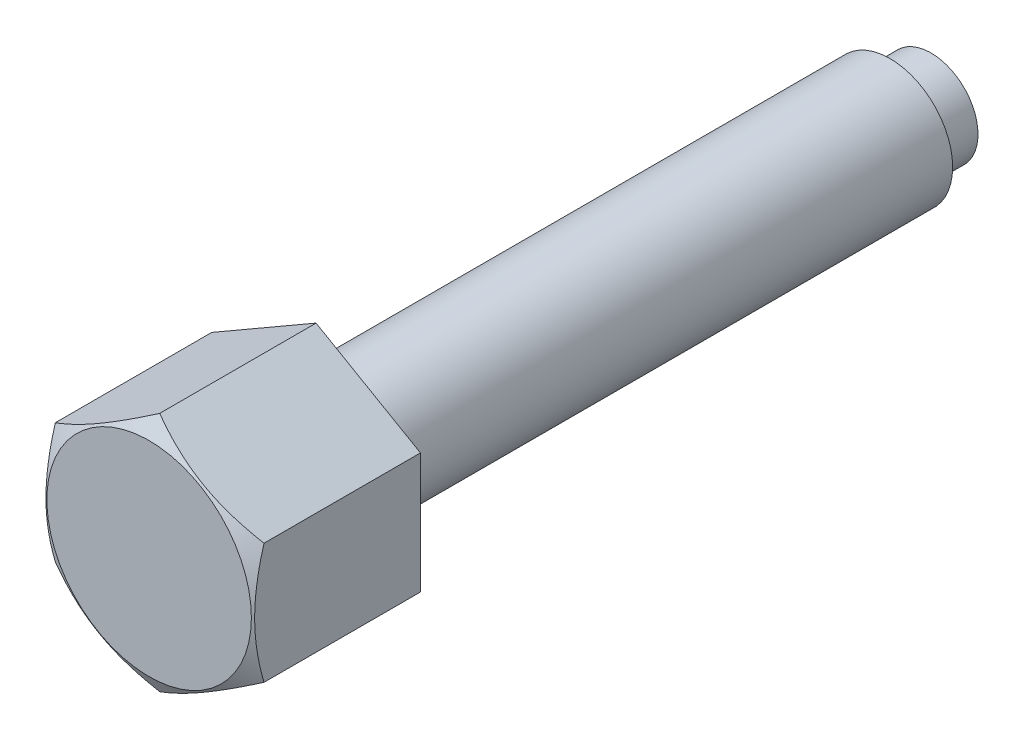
ISO-10303-21;
HEADER;
FILE_DESCRIPTION(('STEP AP214'),'2;1');
FILE_NAME('part.step','',(''),(''),'','','');
FILE_SCHEMA(('AUTOMOTIVE_DESIGN { 1 0 10303 214 1 1 1 1 }'));
ENDSEC;
DATA;
#1=APPLICATION_CONTEXT('core data for automotive mechanical design processes');
#2=APPLICATION_PROTOCOL_DEFINITION('international standard','automotive_design',2000,#1);
#3=PRODUCT_CONTEXT('',#1,'mechanical');
#4=PRODUCT('Part','Part','',(#3));
#5=PRODUCT_RELATED_PRODUCT_CATEGORY('part','',(#4));
#6=PRODUCT_DEFINITION_FORMATION('','',#4);
#7=PRODUCT_DEFINITION_CONTEXT('part definition',#1,'design');
#8=PRODUCT_DEFINITION('design','',#6,#7);
#9=PRODUCT_DEFINITION_SHAPE('','',#8);
#10=(LENGTH_UNIT() NAMED_UNIT(*) SI_UNIT(.MILLI.,.METRE.));
#11=(NAMED_UNIT(*) PLANE_ANGLE_UNIT() SI_UNIT($,.RADIAN.));
#12=(NAMED_UNIT(*) SI_UNIT($,.STERADIAN.) SOLID_ANGLE_UNIT());
#13=UNCERTAINTY_MEASURE_WITH_UNIT(LENGTH_MEASURE(1.E-05),#10,'distance_accuracy_value','');
#14=(GEOMETRIC_REPRESENTATION_CONTEXT(3) GLOBAL_UNCERTAINTY_ASSIGNED_CONTEXT((#13)) GLOBAL_UNIT_ASSIGNED_CONTEXT((#10,
#11,#12)) REPRESENTATION_CONTEXT('',''));
#15=CARTESIAN_POINT('',(0.,0.,0.));
#16=DIRECTION('',(0.,0.,1.));
#17=DIRECTION('',(1.,0.,0.));
#18=AXIS2_PLACEMENT_3D('',#15,#16,#17);
#19=CARTESIAN_POINT('',(0.,5.77350269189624,28.));
#20=DIRECTION('',(-0.5,-0.86602540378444,0.));
#21=DIRECTION('',(0.86602540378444,-0.5,0.));
#22=AXIS2_PLACEMENT_3D('',#19,#20,#21);
#23=PLANE('',#22);
#24=CARTESIAN_POINT('',(5.0002,2.88663587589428,37.4956163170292));
#25=CARTESIAN_POINT('',(4.78046540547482,3.01349970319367,37.5688784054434));
#26=CARTESIAN_POINT('',(4.55885141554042,3.14144859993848,37.6355136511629));
#27=CARTESIAN_POINT('',(4.11178600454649,3.3995619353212,37.7518259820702));
#28=CARTESIAN_POINT('',(3.88632664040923,3.52973095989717,37.8014619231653));
#29=CARTESIAN_POINT('',(3.43816769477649,3.78847564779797,37.8787139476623));
#30=CARTESIAN_POINT('',(3.21553790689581,3.91701101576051,37.9068445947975));
#31=CARTESIAN_POINT('',(2.88081009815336,4.11026620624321,37.9320700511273));
#32=CARTESIAN_POINT('',(2.76915780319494,4.1747286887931,37.9376515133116));
#33=CARTESIAN_POINT('',(2.5457500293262,4.30371322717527,37.9430627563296));
#34=CARTESIAN_POINT('',(2.43399455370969,4.36823528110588,37.9428927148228));
#35=CARTESIAN_POINT('',(2.12781576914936,4.54500768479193,37.934511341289));
#36=CARTESIAN_POINT('',(1.93349391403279,4.65719946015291,37.9204352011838));
#37=CARTESIAN_POINT('',(1.5461398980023,4.8808384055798,37.8757997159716));
#38=CARTESIAN_POINT('',(1.35310909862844,4.99228478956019,37.8452251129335));
#39=CARTESIAN_POINT('',(0.964974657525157,5.21637431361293,37.7687964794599));
#40=CARTESIAN_POINT('',(0.769920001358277,5.32898917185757,37.7226185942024));
#41=CARTESIAN_POINT('',(0.382719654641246,5.55253939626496,37.6178131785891));
#42=CARTESIAN_POINT('',(0.190569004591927,5.6634776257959,37.5592102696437));
#43=CARTESIAN_POINT('',(-0.000199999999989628,5.77361816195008,37.4956163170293));
#44=B_SPLINE_CURVE_WITH_KNOTS('',3,(#24,#25,#26,#27,#28,#29,#30,#31,#32,#33,#34,#35,#36,#37,#38,
#39,#40,#41,#42,#43),.UNSPECIFIED.,.F.,.F.,(4,2,2,2,2,2,2,2,2,4),(0.,0.79255584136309,
1.58701660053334,2.36181537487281,2.74884076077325,3.13585419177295,3.80962362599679,
4.48401723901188,5.17336882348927,5.86136694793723),.UNSPECIFIED.);
#45=CARTESIAN_POINT('',(5.,2.88675134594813,37.4956829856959));
#46=VERTEX_POINT('',#45);
#47=CARTESIAN_POINT('',(0.,5.77350269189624,37.4956829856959));
#48=VERTEX_POINT('',#47);
#49=EDGE_CURVE('E30',#46,#48,#44,.T.);
#50=ORIENTED_EDGE('',*,*,#49,.F.);
#51=DIRECTION('',(0.,0.,1.));
#52=VECTOR('',#51,1.);
#53=CARTESIAN_POINT('',(5.,2.88675134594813,28.));
#54=LINE('',#53,#52);
#55=CARTESIAN_POINT('',(5.,2.88675134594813,30.));
#56=VERTEX_POINT('',#55);
#57=EDGE_CURVE('E97',#56,#46,#54,.T.);
#58=ORIENTED_EDGE('',*,*,#57,.F.);
#59=DIRECTION('',(0.86602540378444,-0.5,0.));
#60=VECTOR('',#59,1.);
#61=CARTESIAN_POINT('',(4.75,3.03108891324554,30.));
#62=LINE('',#61,#60);
#63=CARTESIAN_POINT('',(0.,5.77350269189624,30.));
#64=VERTEX_POINT('',#63);
#65=EDGE_CURVE('E111',#64,#56,#62,.T.);
#66=ORIENTED_EDGE('',*,*,#65,.F.);
#67=DIRECTION('',(0.,0.,1.));
#68=VECTOR('',#67,1.);
#69=CARTESIAN_POINT('',(0.,5.77350269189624,28.));
#70=LINE('',#69,#68);
#71=EDGE_CURVE('E37',#64,#48,#70,.T.);
#72=ORIENTED_EDGE('',*,*,#71,.T.);
#73=EDGE_LOOP('',(#50,#58,#66,#72));
#74=FACE_BOUND('',#73,.T.);
#75=ADVANCED_FACE('F15',(#74),#23,.F.);
#76=CARTESIAN_POINT('',(5.,2.88675134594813,28.));
#77=DIRECTION('',(-1.,0.,0.));
#78=DIRECTION('',(0.,-1.,0.));
#79=AXIS2_PLACEMENT_3D('',#76,#77,#78);
#80=PLANE('',#79);
#81=CARTESIAN_POINT('',(5.,-7.73626587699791,35.5108145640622));
#82=CARTESIAN_POINT('',(5.,-7.51803395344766,35.6166045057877));
#83=CARTESIAN_POINT('',(5.,-7.29929913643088,35.7213749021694));
#84=CARTESIAN_POINT('',(5.,-6.86055621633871,35.9283028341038));
#85=CARTESIAN_POINT('',(5.,-6.64054791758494,36.0304599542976));
#86=CARTESIAN_POINT('',(5.,-6.19784836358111,36.2321053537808));
#87=CARTESIAN_POINT('',(5.,-5.97514901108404,36.3315759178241));
#88=CARTESIAN_POINT('',(5.,-5.52797276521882,36.5264224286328));
#89=CARTESIAN_POINT('',(5.,-5.3034959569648,36.6217985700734));
#90=CARTESIAN_POINT('',(5.,-4.84522838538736,36.8103282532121));
#91=CARTESIAN_POINT('',(5.,-4.61136846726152,36.9033146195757));
#92=CARTESIAN_POINT('',(5.,-4.14090595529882,37.0822063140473));
#93=CARTESIAN_POINT('',(5.,-3.90430305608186,37.1681108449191));
#94=CARTESIAN_POINT('',(5.,-3.4284269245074,37.3305705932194));
#95=CARTESIAN_POINT('',(5.,-3.18916027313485,37.4071448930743));
#96=CARTESIAN_POINT('',(5.,-2.70719488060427,37.5484751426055));
#97=CARTESIAN_POINT('',(5.,-2.46449725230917,37.6132348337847));
#98=CARTESIAN_POINT('',(5.,-1.97687778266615,37.7274721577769));
#99=CARTESIAN_POINT('',(5.,-1.73197558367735,37.7770320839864));
#100=CARTESIAN_POINT('',(5.,-1.23914432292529,37.8580568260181));
#101=CARTESIAN_POINT('',(5.,-0.991215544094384,37.8895233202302));
#102=CARTESIAN_POINT('',(5.,-0.496800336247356,37.9314387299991));
#103=CARTESIAN_POINT('',(5.,-0.250337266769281,37.9421564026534));
#104=CARTESIAN_POINT('',(5.,0.242617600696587,37.9423718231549));
#105=CARTESIAN_POINT('',(5.,0.48910939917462,37.9318691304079));
#106=CARTESIAN_POINT('',(5.,0.90811306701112,37.8967196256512));
#107=CARTESIAN_POINT('',(5.,1.08107513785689,37.8771373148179));
#108=CARTESIAN_POINT('',(5.,1.42571379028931,37.8287531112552));
#109=CARTESIAN_POINT('',(5.,1.5973901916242,37.7999499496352));
#110=CARTESIAN_POINT('',(5.,2.11027344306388,37.7012251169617));
#111=CARTESIAN_POINT('',(5.,2.44913862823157,37.6190066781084));
#112=CARTESIAN_POINT('',(5.,2.95580579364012,37.4766856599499));
#113=CARTESIAN_POINT('',(5.,3.126240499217,37.4254239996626));
#114=CARTESIAN_POINT('',(5.,3.46545379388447,37.3176385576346));
#115=CARTESIAN_POINT('',(5.,3.63423237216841,37.2611147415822));
#116=CARTESIAN_POINT('',(5.,3.97018806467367,37.143706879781));
#117=CARTESIAN_POINT('',(5.,4.1373657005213,37.0828243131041));
#118=CARTESIAN_POINT('',(5.,4.4703400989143,36.9574090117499));
#119=CARTESIAN_POINT('',(5.,4.63613687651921,36.8928763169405));
#120=CARTESIAN_POINT('',(5.,5.02279899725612,36.7382562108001));
#121=CARTESIAN_POINT('',(5.,5.24317767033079,36.6469541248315));
#122=CARTESIAN_POINT('',(5.,5.68209744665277,36.4600232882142));
#123=CARTESIAN_POINT('',(5.,5.90063844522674,36.3643942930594));
#124=CARTESIAN_POINT('',(5.,6.33621551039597,36.169666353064));
#125=CARTESIAN_POINT('',(5.,6.55325127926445,36.0705667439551));
#126=CARTESIAN_POINT('',(5.,6.98602870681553,35.8695768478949));
#127=CARTESIAN_POINT('',(5.,7.20177033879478,35.7676865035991));
#128=CARTESIAN_POINT('',(5.,7.84778351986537,35.4584362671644));
#129=CARTESIAN_POINT('',(5.,8.27643028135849,35.2476843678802));
#130=CARTESIAN_POINT('',(5.,9.13064524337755,34.8200322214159));
#131=CARTESIAN_POINT('',(5.,9.55621333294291,34.603131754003));
#132=CARTESIAN_POINT('',(5.,10.1754231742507,34.2834910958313));
#133=CARTESIAN_POINT('',(5.,10.3699617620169,34.1824831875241));
#134=CARTESIAN_POINT('',(5.,10.7586153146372,33.9796640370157));
#135=CARTESIAN_POINT('',(5.,10.9527302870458,33.8778528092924));
#136=CARTESIAN_POINT('',(5.,11.534541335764,33.571367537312));
#137=CARTESIAN_POINT('',(5.,11.921687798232,33.3656500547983));
#138=CARTESIAN_POINT('',(5.,12.6939118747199,32.952589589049));
#139=CARTESIAN_POINT('',(5.,13.078992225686,32.7452517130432));
#140=CARTESIAN_POINT('',(5.,13.8482220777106,32.3289045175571));
#141=CARTESIAN_POINT('',(5.,14.2323716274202,32.1198952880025));
#142=CARTESIAN_POINT('',(5.,14.616177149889,31.9102601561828));
#143=B_SPLINE_CURVE_WITH_KNOTS('',3,(#81,#82,#83,#84,#85,#86,#87,#88,#89,#90,#91,#92,#93,#94,
#95,#96,#97,#98,#99,#100,#101,#102,#103,#104,#105,#106,#107,#108,#109,#110,#111,#112,#113,#114,
#115,#116,#117,#118,#119,#120,#121,#122,#123,#124,#125,#126,#127,#128,#129,#130,#131,#132,#133,
#134,#135,#136,#137,#138,#139,#140,#141,#142),.UNSPECIFIED.,.F.,.F.,(4,2,2,2,2,2,2,2,2,2,2,2,2,
2,2,2,2,2,2,2,2,2,2,2,2,2,2,2,2,2,4),(0.,0.727573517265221,1.45526196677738,2.18694240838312,
2.91858802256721,3.6735042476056,4.4285053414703,5.18193540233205,5.93512644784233,
6.68416454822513,7.4331331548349,8.17233378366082,8.91154976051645,9.43349738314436,
9.95551686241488,11.0001429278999,11.5340289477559,12.067918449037,12.6016276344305,
13.1353309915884,13.8508986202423,14.566506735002,15.2822525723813,15.9980131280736,
17.4308944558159,18.8638271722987,19.521420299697,20.1790016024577,21.4942173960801,
22.8062660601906,24.1182445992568),.UNSPECIFIED.);
#144=CARTESIAN_POINT('',(5.,-2.88675134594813,37.4956829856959));
#145=VERTEX_POINT('',#144);
#146=EDGE_CURVE('E157',#145,#46,#143,.T.);
#147=ORIENTED_EDGE('',*,*,#146,.F.);
#148=DIRECTION('',(0.,0.,1.));
#149=VECTOR('',#148,1.);
#150=CARTESIAN_POINT('',(5.,-2.88675134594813,28.));
#151=LINE('',#150,#149);
#152=CARTESIAN_POINT('',(5.,-2.88675134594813,30.));
#153=VERTEX_POINT('',#152);
#154=EDGE_CURVE('E94',#153,#145,#151,.T.);
#155=ORIENTED_EDGE('',*,*,#154,.F.);
#156=DIRECTION('',(0.,-1.,0.));
#157=VECTOR('',#156,1.);
#158=CARTESIAN_POINT('',(5.,0.,30.));
#159=LINE('',#158,#157);
#160=EDGE_CURVE('E108',#56,#153,#159,.T.);
#161=ORIENTED_EDGE('',*,*,#160,.F.);
#162=ORIENTED_EDGE('',*,*,#57,.T.);
#163=EDGE_LOOP('',(#147,#155,#161,#162));
#164=FACE_BOUND('',#163,.T.);
#165=ADVANCED_FACE('F137',(#164),#80,.F.);
#166=CARTESIAN_POINT('',(0.,-5.77350269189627,28.));
#167=DIRECTION('',(0.5,-0.866025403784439,0.));
#168=DIRECTION('',(0.866025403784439,0.5,0.));
#169=AXIS2_PLACEMENT_3D('',#166,#167,#168);
#170=PLANE('',#169);
#171=ORIENTED_EDGE('',*,*,#154,.T.);
#172=CARTESIAN_POINT('',(5.0002,-2.88663587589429,37.4956163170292));
#173=CARTESIAN_POINT('',(4.78046540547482,-3.01349970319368,37.5688784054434));
#174=CARTESIAN_POINT('',(4.55885141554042,-3.14144859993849,37.6355136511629));
#175=CARTESIAN_POINT('',(4.11178600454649,-3.39956193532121,37.7518259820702));
#176=CARTESIAN_POINT('',(3.88632664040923,-3.52973095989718,37.8014619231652));
#177=CARTESIAN_POINT('',(3.43816769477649,-3.78847564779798,37.8787139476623));
#178=CARTESIAN_POINT('',(3.21553790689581,-3.91701101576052,37.9068445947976));
#179=CARTESIAN_POINT('',(2.88081009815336,-4.11026620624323,37.9320700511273));
#180=CARTESIAN_POINT('',(2.76915780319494,-4.17472868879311,37.9376515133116));
#181=CARTESIAN_POINT('',(2.5457500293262,-4.30371322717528,37.9430627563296));
#182=CARTESIAN_POINT('',(2.43399455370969,-4.36823528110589,37.9428927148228));
#183=CARTESIAN_POINT('',(2.12781576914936,-4.54500768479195,37.934511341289));
#184=CARTESIAN_POINT('',(1.93349391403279,-4.65719946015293,37.9204352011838));
#185=CARTESIAN_POINT('',(1.54613989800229,-4.88083840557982,37.8757997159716));
#186=CARTESIAN_POINT('',(1.35310909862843,-4.99228478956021,37.8452251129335));
#187=CARTESIAN_POINT('',(0.964974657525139,-5.21637431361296,37.7687964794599));
#188=CARTESIAN_POINT('',(0.769920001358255,-5.3289891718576,37.7226185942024));
#189=CARTESIAN_POINT('',(0.38271965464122,-5.55253939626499,37.6178131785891));
#190=CARTESIAN_POINT('',(0.190569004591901,-5.66347762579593,37.5592102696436));
#191=CARTESIAN_POINT('',(-0.00020000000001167,-5.77361816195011,37.4956163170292));
#192=B_SPLINE_CURVE_WITH_KNOTS('',3,(#172,#173,#174,#175,#176,#177,#178,#179,#180,#181,#182,
#183,#184,#185,#186,#187,#188,#189,#190,#191),.UNSPECIFIED.,.F.,.F.,(4,2,2,2,2,2,2,2,2,4),(0.,
0.792555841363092,1.58701660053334,2.36181537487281,2.74884076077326,3.13585419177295,
3.8096236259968,4.4840172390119,5.1733688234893,5.86136694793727),.UNSPECIFIED.);
#193=CARTESIAN_POINT('',(0.,-5.77350269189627,37.4956829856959));
#194=VERTEX_POINT('',#193);
#195=EDGE_CURVE('E163',#145,#194,#192,.T.);
#196=ORIENTED_EDGE('',*,*,#195,.T.);
#197=DIRECTION('',(0.,0.,1.));
#198=VECTOR('',#197,1.);
#199=CARTESIAN_POINT('',(0.,-5.77350269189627,28.));
#200=LINE('',#199,#198);
#201=CARTESIAN_POINT('',(0.,-5.77350269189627,30.));
#202=VERTEX_POINT('',#201);
#203=EDGE_CURVE('E87',#202,#194,#200,.T.);
#204=ORIENTED_EDGE('',*,*,#203,.F.);
#205=DIRECTION('',(0.866025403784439,0.5,0.));
#206=VECTOR('',#205,1.);
#207=CARTESIAN_POINT('',(4.75,-3.03108891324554,30.));
#208=LINE('',#207,#206);
#209=EDGE_CURVE('E106',#202,#153,#208,.T.);
#210=ORIENTED_EDGE('',*,*,#209,.T.);
#211=EDGE_LOOP('',(#171,#196,#204,#210));
#212=FACE_BOUND('',#211,.T.);
#213=ADVANCED_FACE('F143',(#212),#170,.T.);
#214=CARTESIAN_POINT('',(0.,-5.77350269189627,28.));
#215=DIRECTION('',(0.5,0.866025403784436,0.));
#216=DIRECTION('',(-0.866025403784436,0.5,0.));
#217=AXIS2_PLACEMENT_3D('',#214,#215,#216);
#218=PLANE('',#217);
#219=CARTESIAN_POINT('',(-5.0002,-2.8866358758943,37.4956163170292));
#220=CARTESIAN_POINT('',(-4.78046540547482,-3.01349970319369,37.5688784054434));
#221=CARTESIAN_POINT('',(-4.55885141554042,-3.1414485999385,37.6355136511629));
#222=CARTESIAN_POINT('',(-4.11178600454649,-3.39956193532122,37.7518259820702));
#223=CARTESIAN_POINT('',(-3.88632664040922,-3.52973095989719,37.8014619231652));
#224=CARTESIAN_POINT('',(-3.43816769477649,-3.78847564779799,37.8787139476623));
#225=CARTESIAN_POINT('',(-3.21553790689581,-3.91701101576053,37.9068445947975));
#226=CARTESIAN_POINT('',(-2.88081009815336,-4.11026620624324,37.9320700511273));
#227=CARTESIAN_POINT('',(-2.76915780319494,-4.17472868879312,37.9376515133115));
#228=CARTESIAN_POINT('',(-2.5457500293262,-4.30371322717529,37.9430627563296));
#229=CARTESIAN_POINT('',(-2.43399455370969,-4.3682352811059,37.9428927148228));
#230=CARTESIAN_POINT('',(-2.12781576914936,-4.54500768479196,37.934511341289));
#231=CARTESIAN_POINT('',(-1.93349391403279,-4.65719946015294,37.9204352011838));
#232=CARTESIAN_POINT('',(-1.5461398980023,-4.88083840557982,37.8757997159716));
#233=CARTESIAN_POINT('',(-1.35310909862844,-4.99228478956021,37.8452251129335));
#234=CARTESIAN_POINT('',(-0.964974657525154,-5.21637431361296,37.7687964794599));
#235=CARTESIAN_POINT('',(-0.769920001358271,-5.3289891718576,37.7226185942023));
#236=CARTESIAN_POINT('',(-0.38271965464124,-5.552539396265,37.6178131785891));
#237=CARTESIAN_POINT('',(-0.190569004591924,-5.66347762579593,37.5592102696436));
#238=CARTESIAN_POINT('',(0.000199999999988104,-5.77361816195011,37.4956163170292));
#239=B_SPLINE_CURVE_WITH_KNOTS('',3,(#219,#220,#221,#222,#223,#224,#225,#226,#227,#228,#229,
#230,#231,#232,#233,#234,#235,#236,#237,#238),.UNSPECIFIED.,.F.,.F.,(4,2,2,2,2,2,2,2,2,4),(0.,
0.792555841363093,1.58701660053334,2.36181537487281,2.74884076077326,3.13585419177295,
3.80962362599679,4.48401723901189,5.17336882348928,5.86136694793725),.UNSPECIFIED.);
#240=CARTESIAN_POINT('',(-5.,-2.88675134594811,37.4956829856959));
#241=VERTEX_POINT('',#240);
#242=EDGE_CURVE('E81',#241,#194,#239,.T.);
#243=ORIENTED_EDGE('',*,*,#242,.F.);
#244=DIRECTION('',(0.,0.,1.));
#245=VECTOR('',#244,1.);
#246=CARTESIAN_POINT('',(-5.,-2.88675134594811,28.));
#247=LINE('',#246,#245);
#248=CARTESIAN_POINT('',(-5.,-2.88675134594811,30.));
#249=VERTEX_POINT('',#248);
#250=EDGE_CURVE('E80',#249,#241,#247,.T.);
#251=ORIENTED_EDGE('',*,*,#250,.F.);
#252=DIRECTION('',(-0.866025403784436,0.5,0.));
#253=VECTOR('',#252,1.);
#254=CARTESIAN_POINT('',(-0.250000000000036,-5.62916512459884,30.));
#255=LINE('',#254,#253);
#256=EDGE_CURVE('E103',#202,#249,#255,.T.);
#257=ORIENTED_EDGE('',*,*,#256,.F.);
#258=ORIENTED_EDGE('',*,*,#203,.T.);
#259=EDGE_LOOP('',(#243,#251,#257,#258));
#260=FACE_BOUND('',#259,.T.);
#261=ADVANCED_FACE('F239',(#260),#218,.F.);
#262=CARTESIAN_POINT('',(-5.,2.88675134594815,28.));
#263=DIRECTION('',(-1.,0.,0.));
#264=DIRECTION('',(0.,-1.,0.));
#265=AXIS2_PLACEMENT_3D('',#262,#263,#264);
#266=PLANE('',#265);
#267=ORIENTED_EDGE('',*,*,#250,.T.);
#268=CARTESIAN_POINT('',(-5.,-7.73626587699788,35.5108145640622));
#269=CARTESIAN_POINT('',(-5.,-7.51803395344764,35.6166045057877));
#270=CARTESIAN_POINT('',(-5.,-7.29929913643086,35.7213749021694));
#271=CARTESIAN_POINT('',(-5.,-6.86055621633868,35.9283028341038));
#272=CARTESIAN_POINT('',(-5.,-6.64054791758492,36.0304599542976));
#273=CARTESIAN_POINT('',(-5.,-6.19784836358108,36.2321053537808));
#274=CARTESIAN_POINT('',(-5.,-5.97514901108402,36.3315759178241));
#275=CARTESIAN_POINT('',(-5.,-5.5279727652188,36.5264224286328));
#276=CARTESIAN_POINT('',(-5.,-5.30349595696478,36.6217985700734));
#277=CARTESIAN_POINT('',(-5.,-4.84522838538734,36.8103282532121));
#278=CARTESIAN_POINT('',(-5.,-4.6113684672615,36.9033146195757));
#279=CARTESIAN_POINT('',(-5.,-4.1409059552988,37.0822063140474));
#280=CARTESIAN_POINT('',(-5.,-3.90430305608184,37.1681108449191));
#281=CARTESIAN_POINT('',(-5.,-3.42842692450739,37.3305705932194));
#282=CARTESIAN_POINT('',(-5.,-3.18916027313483,37.4071448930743));
#283=CARTESIAN_POINT('',(-5.,-2.70719488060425,37.5484751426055));
#284=CARTESIAN_POINT('',(-5.,-2.46449725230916,37.6132348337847));
#285=CARTESIAN_POINT('',(-5.,-1.97687778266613,37.7274721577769));
#286=CARTESIAN_POINT('',(-5.,-1.73197558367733,37.7770320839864));
#287=CARTESIAN_POINT('',(-5.,-1.23914432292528,37.8580568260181));
#288=CARTESIAN_POINT('',(-5.,-0.99121554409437,37.8895233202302));
#289=CARTESIAN_POINT('',(-5.,-0.496800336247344,37.9314387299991));
#290=CARTESIAN_POINT('',(-5.,-0.250337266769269,37.9421564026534));
#291=CARTESIAN_POINT('',(-5.,0.242617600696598,37.9423718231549));
#292=CARTESIAN_POINT('',(-5.,0.489109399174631,37.9318691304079));
#293=CARTESIAN_POINT('',(-5.,0.908113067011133,37.8967196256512));
#294=CARTESIAN_POINT('',(-5.,1.08107513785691,37.8771373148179));
#295=CARTESIAN_POINT('',(-5.,1.42571379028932,37.8287531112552));
#296=CARTESIAN_POINT('',(-5.,1.59739019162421,37.7999499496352));
#297=CARTESIAN_POINT('',(-5.,2.1102734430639,37.7012251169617));
#298=CARTESIAN_POINT('',(-5.,2.44913862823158,37.6190066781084));
#299=CARTESIAN_POINT('',(-5.,2.95580579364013,37.4766856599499));
#300=CARTESIAN_POINT('',(-5.,3.12624049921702,37.4254239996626));
#301=CARTESIAN_POINT('',(-5.,3.46545379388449,37.3176385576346));
#302=CARTESIAN_POINT('',(-5.,3.63423237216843,37.2611147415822));
#303=CARTESIAN_POINT('',(-5.,3.97018806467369,37.143706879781));
#304=CARTESIAN_POINT('',(-5.,4.13736570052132,37.0828243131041));
#305=CARTESIAN_POINT('',(-5.,4.47034009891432,36.9574090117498));
#306=CARTESIAN_POINT('',(-5.,4.63613687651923,36.8928763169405));
#307=CARTESIAN_POINT('',(-5.,5.02279899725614,36.7382562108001));
#308=CARTESIAN_POINT('',(-5.,5.24317767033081,36.6469541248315));
#309=CARTESIAN_POINT('',(-5.,5.68209744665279,36.4600232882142));
#310=CARTESIAN_POINT('',(-5.,5.90063844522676,36.3643942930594));
#311=CARTESIAN_POINT('',(-5.,6.33621551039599,36.169666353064));
#312=CARTESIAN_POINT('',(-5.,6.55325127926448,36.0705667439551));
#313=CARTESIAN_POINT('',(-5.,6.98602870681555,35.8695768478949));
#314=CARTESIAN_POINT('',(-5.,7.2017703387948,35.7676865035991));
#315=CARTESIAN_POINT('',(-5.,7.84778351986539,35.4584362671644));
#316=CARTESIAN_POINT('',(-5.,8.2764302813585,35.2476843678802));
#317=CARTESIAN_POINT('',(-5.,9.13064524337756,34.8200322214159));
#318=CARTESIAN_POINT('',(-5.,9.55621333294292,34.603131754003));
#319=CARTESIAN_POINT('',(-5.,10.1754231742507,34.2834910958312));
#320=CARTESIAN_POINT('',(-5.,10.369961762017,34.1824831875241));
#321=CARTESIAN_POINT('',(-5.,10.7586153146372,33.9796640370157));
#322=CARTESIAN_POINT('',(-5.,10.9527302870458,33.8778528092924));
#323=CARTESIAN_POINT('',(-5.,11.534541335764,33.571367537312));
#324=CARTESIAN_POINT('',(-5.,11.921687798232,33.3656500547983));
#325=CARTESIAN_POINT('',(-5.,12.6939118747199,32.952589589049));
#326=CARTESIAN_POINT('',(-5.,13.078992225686,32.7452517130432));
#327=CARTESIAN_POINT('',(-5.,13.8482220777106,32.3289045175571));
#328=CARTESIAN_POINT('',(-5.,14.2323716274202,32.1198952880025));
#329=CARTESIAN_POINT('',(-5.,14.616177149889,31.9102601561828));
#330=B_SPLINE_CURVE_WITH_KNOTS('',3,(#268,#269,#270,#271,#272,#273,#274,#275,#276,#277,#278,
#279,#280,#281,#282,#283,#284,#285,#286,#287,#288,#289,#290,#291,#292,#293,#294,#295,#296,#297,
#298,#299,#300,#301,#302,#303,#304,#305,#306,#307,#308,#309,#310,#311,#312,#313,#314,#315,#316,
#317,#318,#319,#320,#321,#322,#323,#324,#325,#326,#327,#328,#329),.UNSPECIFIED.,.F.,.F.,(4,2,2,
2,2,2,2,2,2,2,2,2,2,2,2,2,2,2,2,2,2,2,2,2,2,2,2,2,2,2,4),(0.,0.727573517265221,1.45526196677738,
2.18694240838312,2.9185880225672,3.67350424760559,4.42850534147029,5.18193540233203,
5.93512644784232,6.68416454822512,7.43313315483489,8.1723337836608,8.91154976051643,
9.43349738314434,9.95551686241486,11.0001429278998,11.5340289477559,12.067918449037,
12.6016276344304,13.1353309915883,13.8508986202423,14.566506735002,15.2822525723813,
15.9980131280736,17.4308944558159,18.8638271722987,19.521420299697,20.1790016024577,
21.49421739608,22.8062660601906,24.1182445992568),.UNSPECIFIED.);
#331=CARTESIAN_POINT('',(-5.,2.88675134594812,37.4956829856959));
#332=VERTEX_POINT('',#331);
#333=EDGE_CURVE('E68',#241,#332,#330,.T.);
#334=ORIENTED_EDGE('',*,*,#333,.T.);
#335=DIRECTION('',(0.,0.,1.));
#336=VECTOR('',#335,1.);
#337=CARTESIAN_POINT('',(-5.,2.88675134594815,28.));
#338=LINE('',#337,#336);
#339=CARTESIAN_POINT('',(-5.,2.88675134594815,30.));
#340=VERTEX_POINT('',#339);
#341=EDGE_CURVE('E77',#340,#332,#338,.T.);
#342=ORIENTED_EDGE('',*,*,#341,.F.);
#343=DIRECTION('',(0.,-1.,0.));
#344=VECTOR('',#343,1.);
#345=CARTESIAN_POINT('',(-5.,0.,30.));
#346=LINE('',#345,#344);
#347=EDGE_CURVE('E101',#340,#249,#346,.T.);
#348=ORIENTED_EDGE('',*,*,#347,.T.);
#349=EDGE_LOOP('',(#267,#334,#342,#348));
#350=FACE_BOUND('',#349,.T.);
#351=ADVANCED_FACE('F76',(#350),#266,.T.);
#352=CARTESIAN_POINT('',(0.,5.77350269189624,28.));
#353=DIRECTION('',(-0.5,0.866025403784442,0.));
#354=DIRECTION('',(-0.866025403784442,-0.5,0.));
#355=AXIS2_PLACEMENT_3D('',#352,#353,#354);
#356=PLANE('',#355);
#357=ORIENTED_EDGE('',*,*,#341,.T.);
#358=CARTESIAN_POINT('',(-5.0002,2.88663587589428,37.4956163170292));
#359=CARTESIAN_POINT('',(-4.78046540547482,3.01349970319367,37.5688784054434));
#360=CARTESIAN_POINT('',(-4.55885141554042,3.14144859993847,37.6355136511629));
#361=CARTESIAN_POINT('',(-4.11178600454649,3.39956193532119,37.7518259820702));
#362=CARTESIAN_POINT('',(-3.88632664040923,3.52973095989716,37.8014619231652));
#363=CARTESIAN_POINT('',(-3.4381676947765,3.78847564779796,37.8787139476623));
#364=CARTESIAN_POINT('',(-3.21553790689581,3.9170110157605,37.9068445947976));
#365=CARTESIAN_POINT('',(-2.88081009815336,4.1102662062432,37.9320700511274));
#366=CARTESIAN_POINT('',(-2.76915780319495,4.17472868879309,37.9376515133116));
#367=CARTESIAN_POINT('',(-2.54575002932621,4.30371322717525,37.9430627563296));
#368=CARTESIAN_POINT('',(-2.43399455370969,4.36823528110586,37.9428927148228));
#369=CARTESIAN_POINT('',(-2.12781576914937,4.54500768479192,37.934511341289));
#370=CARTESIAN_POINT('',(-1.93349391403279,4.6571994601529,37.9204352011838));
#371=CARTESIAN_POINT('',(-1.5461398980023,4.88083840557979,37.8757997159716));
#372=CARTESIAN_POINT('',(-1.35310909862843,4.99228478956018,37.8452251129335));
#373=CARTESIAN_POINT('',(-0.964974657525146,5.21637431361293,37.7687964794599));
#374=CARTESIAN_POINT('',(-0.769920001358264,5.32898917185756,37.7226185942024));
#375=CARTESIAN_POINT('',(-0.382719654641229,5.55253939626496,37.6178131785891));
#376=CARTESIAN_POINT('',(-0.190569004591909,5.6634776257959,37.5592102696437));
#377=CARTESIAN_POINT('',(0.000200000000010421,5.77361816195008,37.4956163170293));
#378=B_SPLINE_CURVE_WITH_KNOTS('',3,(#358,#359,#360,#361,#362,#363,#364,#365,#366,#367,#368,
#369,#370,#371,#372,#373,#374,#375,#376,#377),.UNSPECIFIED.,.F.,.F.,(4,2,2,2,2,2,2,2,2,4),(0.,
0.792555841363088,1.58701660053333,2.3618153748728,2.74884076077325,3.13585419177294,
3.80962362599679,4.48401723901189,5.17336882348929,5.86136694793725),.UNSPECIFIED.);
#379=EDGE_CURVE('E65',#332,#48,#378,.T.);
#380=ORIENTED_EDGE('',*,*,#379,.T.);
#381=ORIENTED_EDGE('',*,*,#71,.F.);
#382=DIRECTION('',(-0.866025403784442,-0.5,0.));
#383=VECTOR('',#382,1.);
#384=CARTESIAN_POINT('',(-0.249999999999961,5.62916512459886,30.));
#385=LINE('',#384,#383);
#386=EDGE_CURVE('E85',#64,#340,#385,.T.);
#387=ORIENTED_EDGE('',*,*,#386,.T.);
#388=EDGE_LOOP('',(#357,#380,#381,#387));
#389=FACE_BOUND('',#388,.T.);
#390=ADVANCED_FACE('F83',(#389),#356,.T.);
#391=CARTESIAN_POINT('',(0.,0.,5.));
#392=DIRECTION('',(0.,0.,1.));
#393=DIRECTION('',(1.,0.,0.));
#394=AXIS2_PLACEMENT_3D('',#391,#392,#393);
#395=SPHERICAL_SURFACE('',#394,5.);
#396=CARTESIAN_POINT('',(0.,0.,0.53485722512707));
#397=DIRECTION('',(0.,0.,1.));
#398=DIRECTION('',(1.,0.,0.));
#399=AXIS2_PLACEMENT_3D('',#396,#397,#398);
#400=CIRCLE('',#399,2.25);
#401=CARTESIAN_POINT('',(2.25,0.,0.53485722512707));
#402=VERTEX_POINT('',#401);
#403=EDGE_CURVE('E9',#402,#402,#400,.T.);
#404=ORIENTED_EDGE('',*,*,#403,.F.);
#405=EDGE_LOOP('',(#404));
#406=FACE_BOUND('',#405,.T.);
#407=ADVANCED_FACE('F17',(#406),#395,.T.);
#408=CARTESIAN_POINT('',(0.,0.,110.));
#409=DIRECTION('',(0.,0.,1.));
#410=DIRECTION('',(1.,0.,0.));
#411=AXIS2_PLACEMENT_3D('',#408,#409,#410);
#412=CYLINDRICAL_SURFACE('',#411,2.25);
#413=ORIENTED_EDGE('',*,*,#403,.T.);
#414=EDGE_LOOP('',(#413));
#415=FACE_BOUND('',#414,.T.);
#416=CARTESIAN_POINT('',(0.,0.,2.5));
#417=DIRECTION('',(0.,0.,1.));
#418=DIRECTION('',(1.,0.,0.));
#419=AXIS2_PLACEMENT_3D('',#416,#417,#418);
#420=CIRCLE('',#419,2.25);
#421=CARTESIAN_POINT('',(2.25,0.,2.5));
#422=VERTEX_POINT('',#421);
#423=EDGE_CURVE('E23',#422,#422,#420,.T.);
#424=ORIENTED_EDGE('',*,*,#423,.F.);
#425=EDGE_LOOP('',(#424));
#426=FACE_BOUND('',#425,.T.);
#427=ADVANCED_FACE('F124',(#415,#426),#412,.T.);
#428=CARTESIAN_POINT('',(2.25,0.,2.5));
#429=DIRECTION('',(0.,0.,1.));
#430=DIRECTION('',(1.,0.,0.));
#431=AXIS2_PLACEMENT_3D('',#428,#429,#430);
#432=PLANE('',#431);
#433=CARTESIAN_POINT('',(0.,0.,2.5));
#434=DIRECTION('',(0.,0.,1.));
#435=DIRECTION('',(1.,0.,0.));
#436=AXIS2_PLACEMENT_3D('',#433,#434,#435);
#437=CIRCLE('',#436,3.);
#438=CARTESIAN_POINT('',(3.,0.,2.5));
#439=VERTEX_POINT('',#438);
#440=EDGE_CURVE('E117',#439,#439,#437,.T.);
#441=ORIENTED_EDGE('',*,*,#440,.F.);
#442=EDGE_LOOP('',(#441));
#443=FACE_BOUND('',#442,.T.);
#444=ORIENTED_EDGE('',*,*,#423,.T.);
#445=EDGE_LOOP('',(#444));
#446=FACE_BOUND('',#445,.T.);
#447=ADVANCED_FACE('F122',(#443,#446),#432,.F.);
#448=CARTESIAN_POINT('',(0.,0.,110.));
#449=DIRECTION('',(0.,0.,1.));
#450=DIRECTION('',(1.,0.,0.));
#451=AXIS2_PLACEMENT_3D('',#448,#449,#450);
#452=CYLINDRICAL_SURFACE('',#451,3.);
#453=CARTESIAN_POINT('',(0.,0.,30.));
#454=DIRECTION('',(0.,0.,1.));
#455=DIRECTION('',(1.,0.,0.));
#456=AXIS2_PLACEMENT_3D('',#453,#454,#455);
#457=CIRCLE('',#456,3.);
#458=CARTESIAN_POINT('',(3.,0.,30.));
#459=VERTEX_POINT('',#458);
#460=EDGE_CURVE('E114',#459,#459,#457,.T.);
#461=ORIENTED_EDGE('',*,*,#460,.F.);
#462=EDGE_LOOP('',(#461));
#463=FACE_BOUND('',#462,.T.);
#464=ORIENTED_EDGE('',*,*,#440,.T.);
#465=EDGE_LOOP('',(#464));
#466=FACE_BOUND('',#465,.T.);
#467=ADVANCED_FACE('F132',(#463,#466),#452,.T.);
#468=CARTESIAN_POINT('',(3.,0.,30.));
#469=DIRECTION('',(0.,0.,1.));
#470=DIRECTION('',(1.,0.,0.));
#471=AXIS2_PLACEMENT_3D('',#468,#469,#470);
#472=PLANE('',#471);
#473=ORIENTED_EDGE('',*,*,#386,.F.);
#474=ORIENTED_EDGE('',*,*,#65,.T.);
#475=ORIENTED_EDGE('',*,*,#160,.T.);
#476=ORIENTED_EDGE('',*,*,#209,.F.);
#477=ORIENTED_EDGE('',*,*,#256,.T.);
#478=ORIENTED_EDGE('',*,*,#347,.F.);
#479=EDGE_LOOP('',(#473,#474,#475,#476,#477,#478));
#480=FACE_BOUND('',#479,.T.);
#481=ORIENTED_EDGE('',*,*,#460,.T.);
#482=EDGE_LOOP('',(#481));
#483=FACE_BOUND('',#482,.T.);
#484=ADVANCED_FACE('F178',(#480,#483),#472,.F.);
#485=CARTESIAN_POINT('',(0.,0.,38.));
#486=DIRECTION('',(0.,0.,-1.));
#487=DIRECTION('',(-1.,0.,0.));
#488=AXIS2_PLACEMENT_3D('',#485,#486,#487);
#489=CONICAL_SURFACE('',#488,4.9,1.0471975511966);
#490=CARTESIAN_POINT('',(0.,0.,38.));
#491=DIRECTION('',(0.,0.,1.));
#492=DIRECTION('',(1.,0.,0.));
#493=AXIS2_PLACEMENT_3D('',#490,#491,#492);
#494=CIRCLE('',#493,4.9);
#495=CARTESIAN_POINT('',(4.9,0.,38.));
#496=VERTEX_POINT('',#495);
#497=EDGE_CURVE('E71',#496,#496,#494,.T.);
#498=ORIENTED_EDGE('',*,*,#497,.F.);
#499=EDGE_LOOP('',(#498));
#500=FACE_BOUND('',#499,.T.);
#501=ORIENTED_EDGE('',*,*,#49,.T.);
#502=ORIENTED_EDGE('',*,*,#379,.F.);
#503=ORIENTED_EDGE('',*,*,#333,.F.);
#504=ORIENTED_EDGE('',*,*,#242,.T.);
#505=ORIENTED_EDGE('',*,*,#195,.F.);
#506=ORIENTED_EDGE('',*,*,#146,.T.);
#507=EDGE_LOOP('',(#501,#502,#503,#504,#505,#506));
#508=FACE_BOUND('',#507,.T.);
#509=ADVANCED_FACE('F67',(#500,#508),#489,.T.);
#510=CARTESIAN_POINT('',(0.,0.,38.));
#511=DIRECTION('',(0.,0.,1.));
#512=DIRECTION('',(1.,0.,0.));
#513=AXIS2_PLACEMENT_3D('',#510,#511,#512);
#514=PLANE('',#513);
#515=ORIENTED_EDGE('',*,*,#497,.T.);
#516=EDGE_LOOP('',(#515));
#517=FACE_BOUND('',#516,.T.);
#518=ADVANCED_FACE('F174',(#517),#514,.T.);
#519=CLOSED_SHELL('',(#75,#165,#213,#261,#351,#390,#407,#427,#447,#467,#484,#509,#518));
#520=MANIFOLD_SOLID_BREP('B1',#519);
#521=ADVANCED_BREP_SHAPE_REPRESENTATION('',(#18,#520),#14);
#522=SHAPE_DEFINITION_REPRESENTATION(#9,#521);
ENDSEC;
END-ISO-10303-21;
